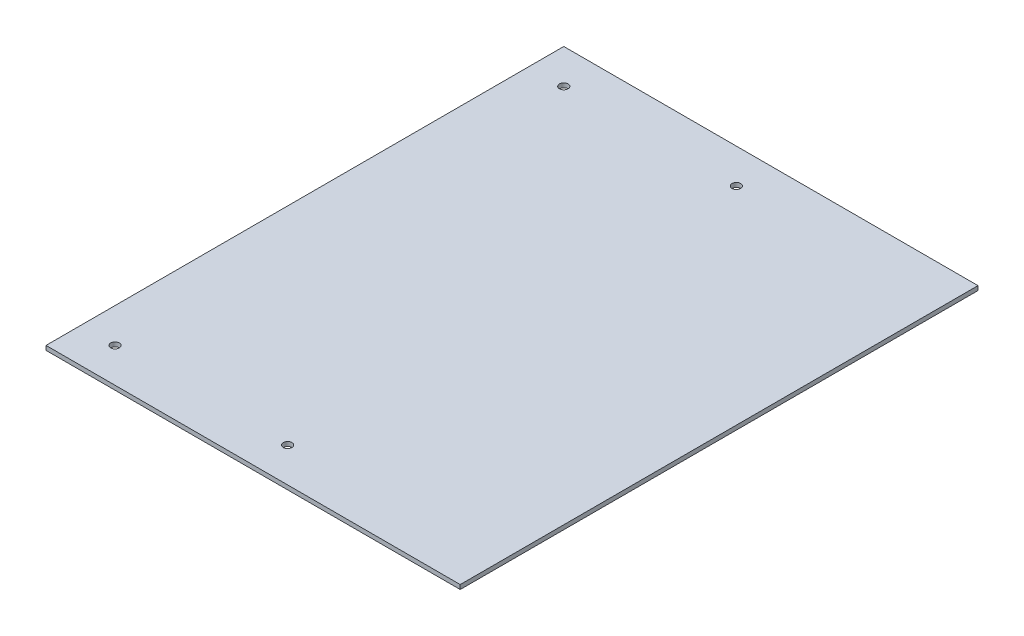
from build123d import *

# Parameters (mm, degrees)
SKETCH_1_W      = 152.4
SKETCH_1_H      = 190.5
SKETCH_1_R      = 1.5875
EXTRUDE_1_DEPTH = 1.5875


with BuildPart() as part:
    # Sketch 1 → Extrude 1 (new body)
    with BuildSketch(Plane(origin=(0, 0, 0), x_dir=(1, 0, 0), z_dir=(0, 1, 0))):
        Rectangle(SKETCH_1_W, SKETCH_1_H)
        with Locations(Location((-63.5, -82.55, 0), (0, 0, 270))):
            Circle(SKETCH_1_R, mode=Mode.SUBTRACT)
        with Locations(Location((0, -82.55, 0), (0, 0, 270))):
            Circle(SKETCH_1_R, mode=Mode.SUBTRACT)
        with Locations(Location((0, 82.55, 0), (0, 0, 90))):
            Circle(SKETCH_1_R, mode=Mode.SUBTRACT)
        with Locations(Location((-63.5, 82.55, 0), (0, 0, 90))):
            Circle(SKETCH_1_R, mode=Mode.SUBTRACT)
    extrude(amount=EXTRUDE_1_DEPTH)


solid = part.part
